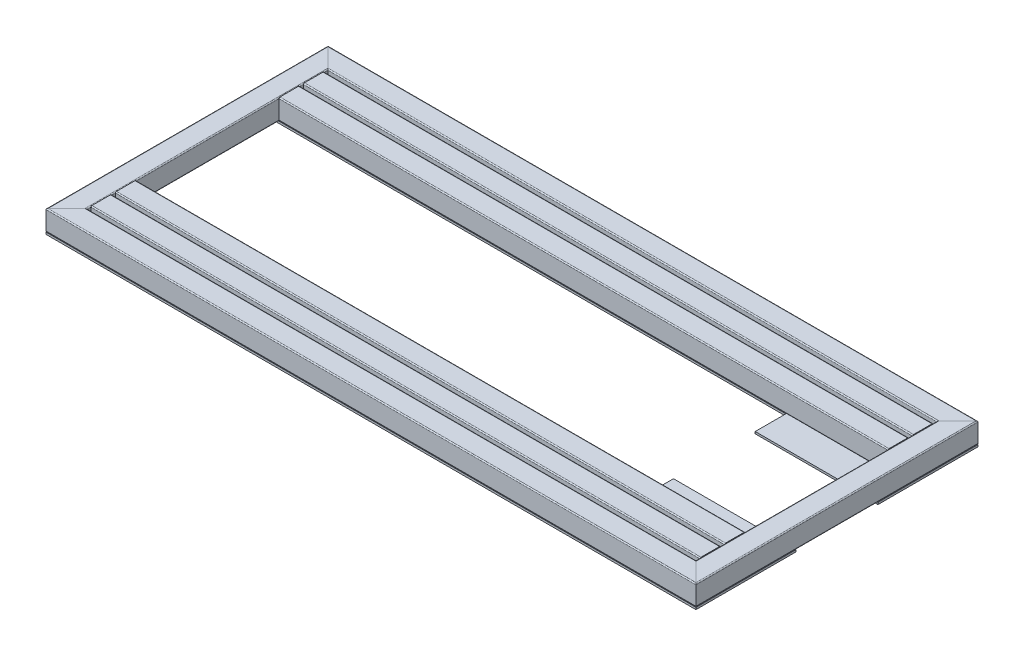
from build123d import *

# Parameters (mm, degrees)
C_100X100X2_1_DEPTH      = 3151.710678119
C_100X100X2_1_DEPTH_BACK = 71.710678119
C_100X100X2_1_2_DEPTH    = 1423.421356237
C_100X100X2_1_3_DEPTH    = 3223.421356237
C_100X100X2_1_4_DEPTH    = 1423.421356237
C_100X100X2_1_5_DEPTH    = 3082
C_100X100X2_1_6_DEPTH    = 3082
C_100X100X2_1_7_DEPTH    = 3082
C_100X100X2_1_8_DEPTH    = 3082
BOSS_EXTRUDE1_DEPTH      = 10
BOSS_EXTRUDE1_2_DEPTH    = 10
SKETCH13_W               = 100
SKETCH13_H               = 55
BOSS_EXTRUDE2_DEPTH      = 100
BOSS_EXTRUDE2_2_DEPTH    = 100
BOSS_EXTRUDE2_3_DEPTH    = 100
BOSS_EXTRUDE2_4_DEPTH    = 100
SKETCH14_R               = 15
CUT_EXTRUDE1_DEPTH       = 2014.535447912


with BuildPart() as part:
    # Sketch11 → C 100X100X2_1 (new, two sides: drawn at the far end of the back side and taken through both)
    with BuildSketch(Plane(origin=(-1540, 0, -640), x_dir=(0, 0, -1), z_dir=(1, 0, 0)).offset(-C_100X100X2_1_DEPTH_BACK)):
        with BuildLine():
            Line((-45, 50), (45, 50))
            ThreePointArc((45, 50), (48.535533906, 48.535533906), (50, 45))
            Line((50, 45), (50, -45))
            ThreePointArc((50, -45), (48.535533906, -48.535533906), (45, -50))
            Line((45, -50), (-45, -50))
            ThreePointArc((-45, -50), (-48.535533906, -48.535533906), (-50, -45))
            Line((-50, -45), (-50, 45))
            ThreePointArc((-50, 45), (-48.535533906, 48.535533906), (-45, 50))
        make_face()
        with BuildLine():
            Line((-48, 45), (-48, -45))
            ThreePointArc((-48, -45), (-47.121320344, -47.121320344), (-45, -48))
            Line((-45, -48), (45, -48))
            ThreePointArc((45, -48), (47.121320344, -47.121320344), (48, -45))
            Line((48, -45), (48, 45))
            ThreePointArc((48, 45), (47.121320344, 47.121320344), (45, 48))
            Line((45, 48), (-45, 48))
            ThreePointArc((-45, 48), (-47.121320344, 47.121320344), (-48, 45))
        make_face(mode=Mode.SUBTRACT)
    extrude(amount=C_100X100X2_1_DEPTH + C_100X100X2_1_DEPTH_BACK)

    # C 100X100X2_1 mitre 1
    split(bisect_by=Plane(origin=(-1540, 0, -640), x_dir=(0, 1, 0), z_dir=(0.707106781, 0, -0.707106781)), keep=Keep.TOP)

    # C 100X100X2_1 mitre 2
    split(bisect_by=Plane(origin=(1540, 0, -640), x_dir=(0, -1, 0), z_dir=(-0.707106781, 0, -0.707106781)), keep=Keep.TOP)


with BuildPart() as body_2:
    # Sketch11 on segment 2 (on carried to segment 2) → C 100X100X2_1 2 (new body)
    with BuildSketch(Plane(origin=(1540, 0, -711.710678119), x_dir=(1, 0, 0), z_dir=(0, 0, 1))):
        with BuildLine():
            Line((-45, 50), (45, 50))
            ThreePointArc((45, 50), (48.535533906, 48.535533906), (50, 45))
            Line((50, 45), (50, -45))
            ThreePointArc((50, -45), (48.535533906, -48.535533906), (45, -50))
            Line((45, -50), (-45, -50))
            ThreePointArc((-45, -50), (-48.535533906, -48.535533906), (-50, -45))
            Line((-50, -45), (-50, 45))
            ThreePointArc((-50, 45), (-48.535533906, 48.535533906), (-45, 50))
        make_face()
        with BuildLine():
            Line((-48, 45), (-48, -45))
            ThreePointArc((-48, -45), (-47.121320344, -47.121320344), (-45, -48))
            Line((-45, -48), (45, -48))
            ThreePointArc((45, -48), (47.121320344, -47.121320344), (48, -45))
            Line((48, -45), (48, 45))
            ThreePointArc((48, 45), (47.121320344, 47.121320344), (45, 48))
            Line((45, 48), (-45, 48))
            ThreePointArc((-45, 48), (-47.121320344, 47.121320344), (-48, 45))
        make_face(mode=Mode.SUBTRACT)
    extrude(amount=C_100X100X2_1_2_DEPTH)

    # C 100X100X2_1 2 mitre 1
    split(bisect_by=Plane(origin=(1540, 0, -640), x_dir=(0, 1, 0), z_dir=(0.707106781, 0, 0.707106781)), keep=Keep.TOP)

    # C 100X100X2_1 2 mitre 2
    split(bisect_by=Plane(origin=(1540, 0, 640), x_dir=(0, 1, 0), z_dir=(0.707106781, 0, -0.707106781)), keep=Keep.TOP)


with BuildPart() as body_3:
    # Sketch11 on segment 3 (on carried to segment 3) → C 100X100X2_1 3 (new body)
    with BuildSketch(Plane(origin=(1611.710678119, 0, 640), x_dir=(0, 0, 1), z_dir=(-1, 0, 0))):
        with BuildLine():
            Line((-45, 50), (45, 50))
            ThreePointArc((45, 50), (48.535533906, 48.535533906), (50, 45))
            Line((50, 45), (50, -45))
            ThreePointArc((50, -45), (48.535533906, -48.535533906), (45, -50))
            Line((45, -50), (-45, -50))
            ThreePointArc((-45, -50), (-48.535533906, -48.535533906), (-50, -45))
            Line((-50, -45), (-50, 45))
            ThreePointArc((-50, 45), (-48.535533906, 48.535533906), (-45, 50))
        make_face()
        with BuildLine():
            Line((-48, 45), (-48, -45))
            ThreePointArc((-48, -45), (-47.121320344, -47.121320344), (-45, -48))
            Line((-45, -48), (45, -48))
            ThreePointArc((45, -48), (47.121320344, -47.121320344), (48, -45))
            Line((48, -45), (48, 45))
            ThreePointArc((48, 45), (47.121320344, 47.121320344), (45, 48))
            Line((45, 48), (-45, 48))
            ThreePointArc((-45, 48), (-47.121320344, 47.121320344), (-48, 45))
        make_face(mode=Mode.SUBTRACT)
    extrude(amount=C_100X100X2_1_3_DEPTH)

    # C 100X100X2_1 3 mitre 1
    split(bisect_by=Plane(origin=(-1540, 0, 640), x_dir=(0, 1, 0), z_dir=(0.707106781, 0, 0.707106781)), keep=Keep.TOP)

    # C 100X100X2_1 3 mitre 2
    split(bisect_by=Plane(origin=(1540, 0, 640), x_dir=(0, -1, 0), z_dir=(-0.707106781, 0, 0.707106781)), keep=Keep.TOP)


with BuildPart() as body_4:
    # Sketch11 on segment 4 (on carried to segment 4) → C 100X100X2_1 4 (new body)
    with BuildSketch(Plane(origin=(-1540, 0, 711.710678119), x_dir=(-1, 0, 0), z_dir=(0, 0, -1))):
        with BuildLine():
            Line((-45, 50), (45, 50))
            ThreePointArc((45, 50), (48.535533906, 48.535533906), (50, 45))
            Line((50, 45), (50, -45))
            ThreePointArc((50, -45), (48.535533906, -48.535533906), (45, -50))
            Line((45, -50), (-45, -50))
            ThreePointArc((-45, -50), (-48.535533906, -48.535533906), (-50, -45))
            Line((-50, -45), (-50, 45))
            ThreePointArc((-50, 45), (-48.535533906, 48.535533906), (-45, 50))
        make_face()
        with BuildLine():
            Line((-48, 45), (-48, -45))
            ThreePointArc((-48, -45), (-47.121320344, -47.121320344), (-45, -48))
            Line((-45, -48), (45, -48))
            ThreePointArc((45, -48), (47.121320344, -47.121320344), (48, -45))
            Line((48, -45), (48, 45))
            ThreePointArc((48, 45), (47.121320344, 47.121320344), (45, 48))
            Line((45, 48), (-45, 48))
            ThreePointArc((-45, 48), (-47.121320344, 47.121320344), (-48, 45))
        make_face(mode=Mode.SUBTRACT)
    extrude(amount=C_100X100X2_1_4_DEPTH)

    # C 100X100X2_1 4 mitre 1
    split(bisect_by=Plane(origin=(-1540, 0, -640), x_dir=(0, -1, 0), z_dir=(-0.707106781, 0, 0.707106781)), keep=Keep.TOP)

    # C 100X100X2_1 4 mitre 2
    split(bisect_by=Plane(origin=(-1540, 0, 640), x_dir=(0, -1, 0), z_dir=(-0.707106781, 0, -0.707106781)), keep=Keep.TOP)


with BuildPart() as body_5:
    # Sketch11 on segment 5 (on carried to segment 5) → C 100X100X2_1 5 (new body)
    with BuildSketch(Plane(origin=(-1541, 0, -520), x_dir=(0, 0, -1), z_dir=(1, 0, 0))):
        with BuildLine():
            Line((-45, 50), (45, 50))
            ThreePointArc((45, 50), (48.535533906, 48.535533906), (50, 45))
            Line((50, 45), (50, -45))
            ThreePointArc((50, -45), (48.535533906, -48.535533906), (45, -50))
            Line((45, -50), (-45, -50))
            ThreePointArc((-45, -50), (-48.535533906, -48.535533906), (-50, -45))
            Line((-50, -45), (-50, 45))
            ThreePointArc((-50, 45), (-48.535533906, 48.535533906), (-45, 50))
        make_face()
        with BuildLine():
            Line((-48, 45), (-48, -45))
            ThreePointArc((-48, -45), (-47.121320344, -47.121320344), (-45, -48))
            Line((-45, -48), (45, -48))
            ThreePointArc((45, -48), (47.121320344, -47.121320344), (48, -45))
            Line((48, -45), (48, 45))
            ThreePointArc((48, 45), (47.121320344, 47.121320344), (45, 48))
            Line((45, 48), (-45, 48))
            ThreePointArc((-45, 48), (-47.121320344, 47.121320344), (-48, 45))
        make_face(mode=Mode.SUBTRACT)
    extrude(amount=C_100X100X2_1_5_DEPTH)

    # C 100X100X2_1 5 mitre 1
    split(bisect_by=Plane(origin=(-1490, 0, -520), x_dir=(0, 1, 0), z_dir=(1, 0, 0)), keep=Keep.TOP)

    # C 100X100X2_1 5 mitre 2
    split(bisect_by=Plane(origin=(1490, 0, -520), x_dir=(0, -1, 0), z_dir=(-1, 0, 0)), keep=Keep.TOP)


with BuildPart() as body_6:
    # Sketch11 on segment 6 (on carried to segment 6) → C 100X100X2_1 6 (new body)
    with BuildSketch(Plane(origin=(-1541, 0, -400), x_dir=(0, 0, -1), z_dir=(1, 0, 0))):
        with BuildLine():
            Line((-45, 50), (45, 50))
            ThreePointArc((45, 50), (48.535533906, 48.535533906), (50, 45))
            Line((50, 45), (50, -45))
            ThreePointArc((50, -45), (48.535533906, -48.535533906), (45, -50))
            Line((45, -50), (-45, -50))
            ThreePointArc((-45, -50), (-48.535533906, -48.535533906), (-50, -45))
            Line((-50, -45), (-50, 45))
            ThreePointArc((-50, 45), (-48.535533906, 48.535533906), (-45, 50))
        make_face()
        with BuildLine():
            Line((-48, 45), (-48, -45))
            ThreePointArc((-48, -45), (-47.121320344, -47.121320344), (-45, -48))
            Line((-45, -48), (45, -48))
            ThreePointArc((45, -48), (47.121320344, -47.121320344), (48, -45))
            Line((48, -45), (48, 45))
            ThreePointArc((48, 45), (47.121320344, 47.121320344), (45, 48))
            Line((45, 48), (-45, 48))
            ThreePointArc((-45, 48), (-47.121320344, 47.121320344), (-48, 45))
        make_face(mode=Mode.SUBTRACT)
    extrude(amount=C_100X100X2_1_6_DEPTH)

    # C 100X100X2_1 6 mitre 1
    split(bisect_by=Plane(origin=(-1490, 0, -400), x_dir=(0, 1, 0), z_dir=(1, 0, 0)), keep=Keep.TOP)

    # C 100X100X2_1 6 mitre 2
    split(bisect_by=Plane(origin=(1490, 0, -400), x_dir=(0, -1, 0), z_dir=(-1, 0, 0)), keep=Keep.TOP)


with BuildPart() as body_7:
    # Sketch11 on segment 7 (on carried to segment 7) → C 100X100X2_1 7 (new body)
    with BuildSketch(Plane(origin=(-1541, 0, 400), x_dir=(0, 0, -1), z_dir=(1, 0, 0))):
        with BuildLine():
            Line((-45, 50), (45, 50))
            ThreePointArc((45, 50), (48.535533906, 48.535533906), (50, 45))
            Line((50, 45), (50, -45))
            ThreePointArc((50, -45), (48.535533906, -48.535533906), (45, -50))
            Line((45, -50), (-45, -50))
            ThreePointArc((-45, -50), (-48.535533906, -48.535533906), (-50, -45))
            Line((-50, -45), (-50, 45))
            ThreePointArc((-50, 45), (-48.535533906, 48.535533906), (-45, 50))
        make_face()
        with BuildLine():
            Line((-48, 45), (-48, -45))
            ThreePointArc((-48, -45), (-47.121320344, -47.121320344), (-45, -48))
            Line((-45, -48), (45, -48))
            ThreePointArc((45, -48), (47.121320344, -47.121320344), (48, -45))
            Line((48, -45), (48, 45))
            ThreePointArc((48, 45), (47.121320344, 47.121320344), (45, 48))
            Line((45, 48), (-45, 48))
            ThreePointArc((-45, 48), (-47.121320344, 47.121320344), (-48, 45))
        make_face(mode=Mode.SUBTRACT)
    extrude(amount=C_100X100X2_1_7_DEPTH)

    # C 100X100X2_1 7 mitre 1
    split(bisect_by=Plane(origin=(-1490, 0, 400), x_dir=(0, 1, 0), z_dir=(1, 0, 0)), keep=Keep.TOP)

    # C 100X100X2_1 7 mitre 2
    split(bisect_by=Plane(origin=(1490, 0, 400), x_dir=(0, -1, 0), z_dir=(-1, 0, 0)), keep=Keep.TOP)


with BuildPart() as body_8:
    # Sketch11 on segment 8 (on carried to segment 8) → C 100X100X2_1 8 (new body)
    with BuildSketch(Plane(origin=(-1541, 0, 520), x_dir=(0, 0, -1), z_dir=(1, 0, 0))):
        with BuildLine():
            Line((-45, 50), (45, 50))
            ThreePointArc((45, 50), (48.535533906, 48.535533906), (50, 45))
            Line((50, 45), (50, -45))
            ThreePointArc((50, -45), (48.535533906, -48.535533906), (45, -50))
            Line((45, -50), (-45, -50))
            ThreePointArc((-45, -50), (-48.535533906, -48.535533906), (-50, -45))
            Line((-50, -45), (-50, 45))
            ThreePointArc((-50, 45), (-48.535533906, 48.535533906), (-45, 50))
        make_face()
        with BuildLine():
            Line((-48, 45), (-48, -45))
            ThreePointArc((-48, -45), (-47.121320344, -47.121320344), (-45, -48))
            Line((-45, -48), (45, -48))
            ThreePointArc((45, -48), (47.121320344, -47.121320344), (48, -45))
            Line((48, -45), (48, 45))
            ThreePointArc((48, 45), (47.121320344, 47.121320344), (45, 48))
            Line((45, 48), (-45, 48))
            ThreePointArc((-45, 48), (-47.121320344, 47.121320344), (-48, 45))
        make_face(mode=Mode.SUBTRACT)
    extrude(amount=C_100X100X2_1_8_DEPTH)

    # C 100X100X2_1 8 mitre 1
    split(bisect_by=Plane(origin=(-1490, 0, 520), x_dir=(0, 1, 0), z_dir=(1, 0, 0)), keep=Keep.TOP)

    # C 100X100X2_1 8 mitre 2
    split(bisect_by=Plane(origin=(1490, 0, 520), x_dir=(0, -1, 0), z_dir=(-1, 0, 0)), keep=Keep.TOP)


with BuildPart() as body_9:
    # Sketch12 → Boss-Extrude1 (new body)
    with BuildSketch(Plane.XZ.offset(50)):
        Polygon((-1590, -690), (1590, -690), (1590, -200), (990, -200), (990, -350), (-1590, -350), align=None)
    extrude(amount=BOSS_EXTRUDE1_DEPTH)


with BuildPart() as body_10:
    # Sketch12 → Boss-Extrude1 2 (new body)
    with BuildSketch(Plane.XZ.offset(50)):
        Polygon((990, 200), (1590, 200), (1590, 690), (-1590, 690), (-1590, 350), (990, 350), align=None)
    extrude(amount=BOSS_EXTRUDE1_2_DEPTH)


with BuildPart() as body_11:
    # Sketch13 → Boss-Extrude2 (new body)
    with BuildSketch(Plane.XZ.offset(60)):
        with Locations((1375, -507.5)):
            Rectangle(SKETCH13_W, SKETCH13_H)
    extrude(amount=BOSS_EXTRUDE2_DEPTH)


with BuildPart() as body_12:
    # Sketch13 → Boss-Extrude2 2 (new body)
    with BuildSketch(Plane.XZ.offset(60)):
        with Locations((1375, -342.5)):
            Rectangle(SKETCH13_W, SKETCH13_H)
    extrude(amount=BOSS_EXTRUDE2_2_DEPTH)


with BuildPart() as body_13:
    # Sketch13 → Boss-Extrude2 3 (new body)
    with BuildSketch(Plane.XZ.offset(60)):
        with Locations((1375, 342.5)):
            Rectangle(SKETCH13_W, SKETCH13_H)
    extrude(amount=BOSS_EXTRUDE2_3_DEPTH)


with BuildPart() as body_14:
    # Sketch13 → Boss-Extrude2 4 (new body)
    with BuildSketch(Plane.XZ.offset(60)):
        with Locations((1375, 507.5)):
            Rectangle(SKETCH13_W, SKETCH13_H)
    extrude(amount=BOSS_EXTRUDE2_4_DEPTH)


with BuildPart() as cut_extrude1_tool:
    # Sketch14 → Cut-Extrude1 (new, through all)
    with BuildSketch(Plane.XY.offset(535)):
        with Locations((1390, -125)):
            Circle(SKETCH14_R)
    extrude(amount=-CUT_EXTRUDE1_DEPTH)


with BuildPart() as body_11_1:
    add(body_11.part)

    # Cut-Extrude1: cut by cut_extrude1_tool
    add(cut_extrude1_tool.part, mode=Mode.SUBTRACT)


with BuildPart() as body_12_1:
    add(body_12.part)

    # Cut-Extrude1: cut by cut_extrude1_tool
    add(cut_extrude1_tool.part, mode=Mode.SUBTRACT)


with BuildPart() as body_13_1:
    add(body_13.part)

    # Cut-Extrude1: cut by cut_extrude1_tool
    add(cut_extrude1_tool.part, mode=Mode.SUBTRACT)


with BuildPart() as body_14_1:
    add(body_14.part)

    # Cut-Extrude1: cut by cut_extrude1_tool
    add(cut_extrude1_tool.part, mode=Mode.SUBTRACT)


solid = Compound([part.part, body_2.part, body_3.part, body_4.part, body_5.part, body_6.part, body_7.part, body_8.part, body_9.part, body_10.part, body_11_1.part, body_12_1.part, body_13_1.part, body_14_1.part])
